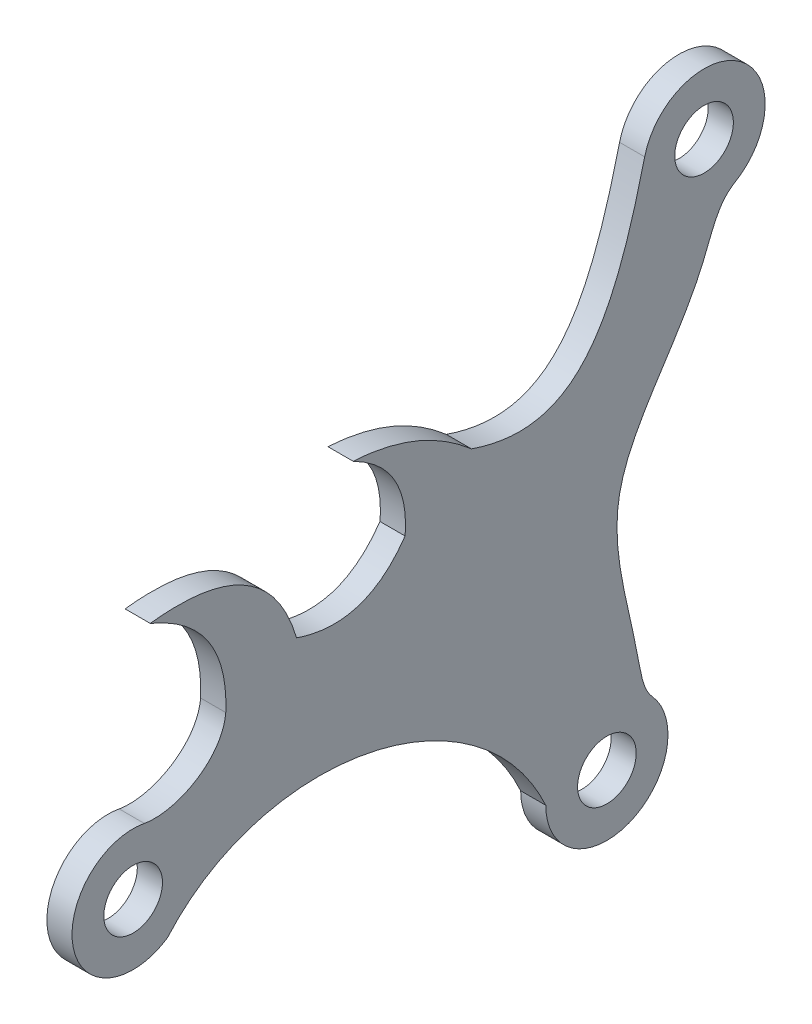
ISO-10303-21;
HEADER;
FILE_DESCRIPTION(('STEP AP214'),'2;1');
FILE_NAME('part.step','',(''),(''),'','','');
FILE_SCHEMA(('AUTOMOTIVE_DESIGN { 1 0 10303 214 1 1 1 1 }'));
ENDSEC;
DATA;
#1=APPLICATION_CONTEXT('core data for automotive mechanical design processes');
#2=APPLICATION_PROTOCOL_DEFINITION('international standard','automotive_design',2000,#1);
#3=PRODUCT_CONTEXT('',#1,'mechanical');
#4=PRODUCT('Part','Part','',(#3));
#5=PRODUCT_RELATED_PRODUCT_CATEGORY('part','',(#4));
#6=PRODUCT_DEFINITION_FORMATION('','',#4);
#7=PRODUCT_DEFINITION_CONTEXT('part definition',#1,'design');
#8=PRODUCT_DEFINITION('design','',#6,#7);
#9=PRODUCT_DEFINITION_SHAPE('','',#8);
#10=(LENGTH_UNIT() NAMED_UNIT(*) SI_UNIT(.MILLI.,.METRE.));
#11=(NAMED_UNIT(*) PLANE_ANGLE_UNIT() SI_UNIT($,.RADIAN.));
#12=(NAMED_UNIT(*) SI_UNIT($,.STERADIAN.) SOLID_ANGLE_UNIT());
#13=UNCERTAINTY_MEASURE_WITH_UNIT(LENGTH_MEASURE(1.E-05),#10,'distance_accuracy_value','');
#14=(GEOMETRIC_REPRESENTATION_CONTEXT(3) GLOBAL_UNCERTAINTY_ASSIGNED_CONTEXT((#13)) GLOBAL_UNIT_ASSIGNED_CONTEXT((#10,
#11,#12)) REPRESENTATION_CONTEXT('',''));
#15=CARTESIAN_POINT('',(0.,0.,0.));
#16=DIRECTION('',(0.,0.,1.));
#17=DIRECTION('',(1.,0.,0.));
#18=AXIS2_PLACEMENT_3D('',#15,#16,#17);
#19=CARTESIAN_POINT('',(6.14583198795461,0.343317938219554,85.1320883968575));
#20=CARTESIAN_POINT('',(6.14583198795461,13.7896292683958,73.4255339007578));
#21=CARTESIAN_POINT('',(6.14583198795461,8.78934319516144,47.9119063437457));
#22=CARTESIAN_POINT('',(6.14583198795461,-8.53825330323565,39.9678569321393));
#23=B_SPLINE_CURVE_WITH_KNOTS('',3,(#19,#20,#21,#22),.UNSPECIFIED.,.F.,.F.,(4,4),(0.,1.),.UNSPECIFIED.);
#24=DIRECTION('',(1.,0.,0.));
#25=VECTOR('',#24,1.);
#26=SURFACE_OF_LINEAR_EXTRUSION('',#23,#25);
#27=DIRECTION('',(1.,0.,0.));
#28=VECTOR('',#27,1.);
#29=CARTESIAN_POINT('',(6.14583198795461,0.343317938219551,85.1320883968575));
#30=LINE('',#29,#28);
#31=CARTESIAN_POINT('',(3.14583198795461,0.343317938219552,85.1320883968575));
#32=VERTEX_POINT('',#31);
#33=CARTESIAN_POINT('',(6.14583198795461,0.343317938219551,85.1320883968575));
#34=VERTEX_POINT('',#33);
#35=EDGE_CURVE('E11',#32,#34,#30,.T.);
#36=ORIENTED_EDGE('',*,*,#35,.F.);
#37=CARTESIAN_POINT('',(3.14583198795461,0.343317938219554,85.1320883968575));
#38=CARTESIAN_POINT('',(3.14583198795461,13.7896292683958,73.4255339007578));
#39=CARTESIAN_POINT('',(3.14583198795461,8.78934319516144,47.9119063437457));
#40=CARTESIAN_POINT('',(3.14583198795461,-8.53825330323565,39.9678569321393));
#41=B_SPLINE_CURVE_WITH_KNOTS('',3,(#37,#38,#39,#40),.UNSPECIFIED.,.F.,.F.,(4,4),(0.,1.),.UNSPECIFIED.);
#42=CARTESIAN_POINT('',(3.14583198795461,-8.53825330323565,39.9678569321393));
#43=VERTEX_POINT('',#42);
#44=EDGE_CURVE('E123',#32,#43,#41,.T.);
#45=ORIENTED_EDGE('',*,*,#44,.T.);
#46=DIRECTION('',(1.,0.,0.));
#47=VECTOR('',#46,1.);
#48=CARTESIAN_POINT('',(6.14583198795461,-8.53825330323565,39.9678569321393));
#49=LINE('',#48,#47);
#50=CARTESIAN_POINT('',(6.14583198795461,-8.53825330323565,39.9678569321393));
#51=VERTEX_POINT('',#50);
#52=EDGE_CURVE('E52',#43,#51,#49,.T.);
#53=ORIENTED_EDGE('',*,*,#52,.T.);
#54=EDGE_CURVE('E240',#34,#51,#23,.T.);
#55=ORIENTED_EDGE('',*,*,#54,.F.);
#56=EDGE_LOOP('',(#36,#45,#53,#55));
#57=FACE_BOUND('',#56,.T.);
#58=ADVANCED_FACE('F42',(#57),#26,.T.);
#59=CARTESIAN_POINT('',(6.14583198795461,-8.53825330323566,32.6761902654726));
#60=DIRECTION('',(1.,0.,0.));
#61=DIRECTION('',(0.,0.,-1.));
#62=AXIS2_PLACEMENT_3D('',#59,#60,#61);
#63=CYLINDRICAL_SURFACE('',#62,7.29166666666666);
#64=ORIENTED_EDGE('',*,*,#52,.F.);
#65=CARTESIAN_POINT('',(3.14583198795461,-8.53825330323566,32.6761902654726));
#66=DIRECTION('',(1.,0.,0.));
#67=DIRECTION('',(0.,0.,-1.));
#68=AXIS2_PLACEMENT_3D('',#65,#66,#67);
#69=CIRCLE('',#68,7.29166666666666);
#70=CARTESIAN_POINT('',(3.14583198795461,-3.65430887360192,27.2618122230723));
#71=VERTEX_POINT('',#70);
#72=EDGE_CURVE('E191',#43,#71,#69,.T.);
#73=ORIENTED_EDGE('',*,*,#72,.T.);
#74=DIRECTION('',(1.,0.,0.));
#75=VECTOR('',#74,1.);
#76=CARTESIAN_POINT('',(6.14583198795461,-3.65430887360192,27.2618122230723));
#77=LINE('',#76,#75);
#78=CARTESIAN_POINT('',(6.14583198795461,-3.65430887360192,27.2618122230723));
#79=VERTEX_POINT('',#78);
#80=EDGE_CURVE('E233',#71,#79,#77,.T.);
#81=ORIENTED_EDGE('',*,*,#80,.T.);
#82=CARTESIAN_POINT('',(6.14583198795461,-8.53825330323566,32.6761902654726));
#83=DIRECTION('',(1.,0.,0.));
#84=DIRECTION('',(0.,0.,-1.));
#85=AXIS2_PLACEMENT_3D('',#82,#83,#84);
#86=CIRCLE('',#85,7.29166666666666);
#87=EDGE_CURVE('E250',#51,#79,#86,.T.);
#88=ORIENTED_EDGE('',*,*,#87,.F.);
#89=EDGE_LOOP('',(#64,#73,#81,#88));
#90=FACE_BOUND('',#89,.T.);
#91=ADVANCED_FACE('F253',(#90),#63,.T.);
#92=CARTESIAN_POINT('',(6.14583198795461,44.5532425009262,17.4187394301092));
#93=CARTESIAN_POINT('',(6.14583198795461,43.4031703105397,19.4015392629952));
#94=CARTESIAN_POINT('',(6.14583198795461,32.9812043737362,22.2499660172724));
#95=CARTESIAN_POINT('',(6.14583198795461,21.0645617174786,34.8204766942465));
#96=CARTESIAN_POINT('',(6.14583198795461,5.59746244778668,29.4926288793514));
#97=CARTESIAN_POINT('',(6.14583198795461,-2.45124837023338,28.3470117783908));
#98=CARTESIAN_POINT('',(6.14583198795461,-3.65430887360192,27.2618122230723));
#99=B_SPLINE_CURVE_WITH_KNOTS('',3,(#92,#93,#94,#95,#96,#97,#98),.UNSPECIFIED.,.F.,.F.,(4,1,1,1,
4),(0.,0.135472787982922,0.556380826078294,0.906488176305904,1.),.UNSPECIFIED.);
#100=DIRECTION('',(1.,0.,0.));
#101=VECTOR('',#100,1.);
#102=SURFACE_OF_LINEAR_EXTRUSION('',#99,#101);
#103=ORIENTED_EDGE('',*,*,#80,.F.);
#104=CARTESIAN_POINT('',(3.14583198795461,44.5532425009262,17.4187394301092));
#105=CARTESIAN_POINT('',(3.14583198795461,43.4031703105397,19.4015392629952));
#106=CARTESIAN_POINT('',(3.14583198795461,32.9812043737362,22.2499660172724));
#107=CARTESIAN_POINT('',(3.14583198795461,21.0645617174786,34.8204766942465));
#108=CARTESIAN_POINT('',(3.14583198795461,5.59746244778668,29.4926288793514));
#109=CARTESIAN_POINT('',(3.14583198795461,-2.45124837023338,28.3470117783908));
#110=CARTESIAN_POINT('',(3.14583198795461,-3.65430887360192,27.2618122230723));
#111=B_SPLINE_CURVE_WITH_KNOTS('',3,(#104,#105,#106,#107,#108,#109,#110),.UNSPECIFIED.,.F.,.F.,
(4,1,1,1,4),(0.,0.135472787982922,0.556380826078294,0.906488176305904,1.),.UNSPECIFIED.);
#112=CARTESIAN_POINT('',(3.14583198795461,44.5532425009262,17.4187394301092));
#113=VERTEX_POINT('',#112);
#114=EDGE_CURVE('E186',#113,#71,#111,.T.);
#115=ORIENTED_EDGE('',*,*,#114,.F.);
#116=DIRECTION('',(1.,0.,0.));
#117=VECTOR('',#116,1.);
#118=CARTESIAN_POINT('',(6.14583198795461,44.5532425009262,17.4187394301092));
#119=LINE('',#118,#117);
#120=CARTESIAN_POINT('',(6.14583198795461,44.5532425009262,17.4187394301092));
#121=VERTEX_POINT('',#120);
#122=EDGE_CURVE('E230',#113,#121,#119,.T.);
#123=ORIENTED_EDGE('',*,*,#122,.T.);
#124=EDGE_CURVE('E254',#121,#79,#99,.T.);
#125=ORIENTED_EDGE('',*,*,#124,.T.);
#126=EDGE_LOOP('',(#103,#115,#123,#125));
#127=FACE_BOUND('',#126,.T.);
#128=ADVANCED_FACE('F271',(#127),#102,.F.);
#129=CARTESIAN_POINT('',(6.14583198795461,50.8606949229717,21.0772154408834));
#130=DIRECTION('',(1.,0.,0.));
#131=DIRECTION('',(0.,0.,-1.));
#132=AXIS2_PLACEMENT_3D('',#129,#130,#131);
#133=CYLINDRICAL_SURFACE('',#132,7.29166666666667);
#134=ORIENTED_EDGE('',*,*,#122,.F.);
#135=CARTESIAN_POINT('',(3.14583198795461,50.8606949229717,21.0772154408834));
#136=DIRECTION('',(1.,0.,0.));
#137=DIRECTION('',(0.,0.,-1.));
#138=AXIS2_PLACEMENT_3D('',#135,#136,#137);
#139=CIRCLE('',#138,7.29166666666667);
#140=CARTESIAN_POINT('',(3.14583198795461,52.5868768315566,28.1616137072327));
#141=VERTEX_POINT('',#140);
#142=EDGE_CURVE('E180',#113,#141,#139,.T.);
#143=ORIENTED_EDGE('',*,*,#142,.T.);
#144=DIRECTION('',(1.,0.,0.));
#145=VECTOR('',#144,1.);
#146=CARTESIAN_POINT('',(6.14583198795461,52.5868768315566,28.1616137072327));
#147=LINE('',#146,#145);
#148=CARTESIAN_POINT('',(6.14583198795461,52.5868768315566,28.1616137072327));
#149=VERTEX_POINT('',#148);
#150=EDGE_CURVE('E227',#141,#149,#147,.T.);
#151=ORIENTED_EDGE('',*,*,#150,.T.);
#152=CARTESIAN_POINT('',(6.14583198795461,50.8606949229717,21.0772154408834));
#153=DIRECTION('',(1.,0.,0.));
#154=DIRECTION('',(0.,0.,-1.));
#155=AXIS2_PLACEMENT_3D('',#152,#153,#154);
#156=CIRCLE('',#155,7.29166666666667);
#157=EDGE_CURVE('E256',#121,#149,#156,.T.);
#158=ORIENTED_EDGE('',*,*,#157,.F.);
#159=EDGE_LOOP('',(#134,#143,#151,#158));
#160=FACE_BOUND('',#159,.T.);
#161=ADVANCED_FACE('F275',(#160),#133,.T.);
#162=CARTESIAN_POINT('',(6.14583198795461,52.5868768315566,28.1616137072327));
#163=CARTESIAN_POINT('',(6.14583198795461,37.0225705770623,31.954006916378));
#164=CARTESIAN_POINT('',(6.14583198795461,28.4922838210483,36.4848949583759));
#165=CARTESIAN_POINT('',(6.14583198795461,32.73852033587,48.8405353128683));
#166=B_SPLINE_CURVE_WITH_KNOTS('',3,(#162,#163,#164,#165),.UNSPECIFIED.,.F.,.F.,(4,4),(0.,1.),.UNSPECIFIED.);
#167=DIRECTION('',(1.,0.,0.));
#168=VECTOR('',#167,1.);
#169=SURFACE_OF_LINEAR_EXTRUSION('',#166,#168);
#170=ORIENTED_EDGE('',*,*,#150,.F.);
#171=CARTESIAN_POINT('',(3.14583198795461,52.5868768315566,28.1616137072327));
#172=CARTESIAN_POINT('',(3.14583198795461,37.0225705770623,31.954006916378));
#173=CARTESIAN_POINT('',(3.14583198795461,28.4922838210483,36.4848949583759));
#174=CARTESIAN_POINT('',(3.14583198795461,32.73852033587,48.8405353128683));
#175=B_SPLINE_CURVE_WITH_KNOTS('',3,(#171,#172,#173,#174),.UNSPECIFIED.,.F.,.F.,(4,4),(0.,1.),.UNSPECIFIED.);
#176=CARTESIAN_POINT('',(3.14583198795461,32.73852033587,48.8405353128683));
#177=VERTEX_POINT('',#176);
#178=EDGE_CURVE('E172',#141,#177,#175,.T.);
#179=ORIENTED_EDGE('',*,*,#178,.T.);
#180=DIRECTION('',(1.,0.,0.));
#181=VECTOR('',#180,1.);
#182=CARTESIAN_POINT('',(6.14583198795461,32.73852033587,48.8405353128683));
#183=LINE('',#182,#181);
#184=CARTESIAN_POINT('',(6.14583198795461,32.73852033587,48.8405353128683));
#185=VERTEX_POINT('',#184);
#186=EDGE_CURVE('E224',#177,#185,#183,.T.);
#187=ORIENTED_EDGE('',*,*,#186,.T.);
#188=EDGE_CURVE('E390',#149,#185,#166,.T.);
#189=ORIENTED_EDGE('',*,*,#188,.F.);
#190=EDGE_LOOP('',(#170,#179,#187,#189));
#191=FACE_BOUND('',#190,.T.);
#192=ADVANCED_FACE('F401',(#191),#169,.T.);
#193=CARTESIAN_POINT('',(6.14583198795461,32.73852033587,48.8405353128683));
#194=CARTESIAN_POINT('',(6.14583198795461,38.0909383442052,54.9856397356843));
#195=CARTESIAN_POINT('',(6.14583198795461,38.5121487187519,62.9527206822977));
#196=B_SPLINE_CURVE_WITH_KNOTS('',2,(#193,#194,#195),.UNSPECIFIED.,.F.,.F.,(3,3),(0.,1.),.UNSPECIFIED.);
#197=DIRECTION('',(1.,0.,0.));
#198=VECTOR('',#197,1.);
#199=SURFACE_OF_LINEAR_EXTRUSION('',#196,#198);
#200=ORIENTED_EDGE('',*,*,#186,.F.);
#201=CARTESIAN_POINT('',(3.14583198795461,32.73852033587,48.8405353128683));
#202=CARTESIAN_POINT('',(3.14583198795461,38.0909383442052,54.9856397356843));
#203=CARTESIAN_POINT('',(3.14583198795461,38.5121487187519,62.9527206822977));
#204=B_SPLINE_CURVE_WITH_KNOTS('',2,(#201,#202,#203),.UNSPECIFIED.,.F.,.F.,(3,3),(0.,1.),.UNSPECIFIED.);
#205=CARTESIAN_POINT('',(3.14583198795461,38.5121487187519,62.9527206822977));
#206=VERTEX_POINT('',#205);
#207=EDGE_CURVE('E164',#177,#206,#204,.T.);
#208=ORIENTED_EDGE('',*,*,#207,.T.);
#209=DIRECTION('',(1.,0.,0.));
#210=VECTOR('',#209,1.);
#211=CARTESIAN_POINT('',(6.14583198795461,38.5121487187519,62.9527206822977));
#212=LINE('',#211,#210);
#213=CARTESIAN_POINT('',(6.14583198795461,38.5121487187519,62.9527206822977));
#214=VERTEX_POINT('',#213);
#215=EDGE_CURVE('E221',#206,#214,#212,.T.);
#216=ORIENTED_EDGE('',*,*,#215,.T.);
#217=EDGE_CURVE('E383',#185,#214,#196,.T.);
#218=ORIENTED_EDGE('',*,*,#217,.F.);
#219=EDGE_LOOP('',(#200,#208,#216,#218));
#220=FACE_BOUND('',#219,.T.);
#221=ADVANCED_FACE('F377',(#220),#199,.T.);
#222=CARTESIAN_POINT('',(6.14583198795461,38.5121487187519,62.9527206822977));
#223=CARTESIAN_POINT('',(6.14583198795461,35.0827299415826,56.1660947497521));
#224=CARTESIAN_POINT('',(6.14583198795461,27.6950162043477,56.7617602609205));
#225=B_SPLINE_CURVE_WITH_KNOTS('',2,(#222,#223,#224),.UNSPECIFIED.,.F.,.F.,(3,3),(0.,1.),.UNSPECIFIED.);
#226=DIRECTION('',(1.,0.,0.));
#227=VECTOR('',#226,1.);
#228=SURFACE_OF_LINEAR_EXTRUSION('',#225,#227);
#229=ORIENTED_EDGE('',*,*,#215,.F.);
#230=CARTESIAN_POINT('',(3.14583198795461,38.5121487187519,62.9527206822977));
#231=CARTESIAN_POINT('',(3.14583198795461,35.0827299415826,56.1660947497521));
#232=CARTESIAN_POINT('',(3.14583198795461,27.6950162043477,56.7617602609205));
#233=B_SPLINE_CURVE_WITH_KNOTS('',2,(#230,#231,#232),.UNSPECIFIED.,.F.,.F.,(3,3),(0.,1.),.UNSPECIFIED.);
#234=CARTESIAN_POINT('',(3.14583198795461,27.6950162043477,56.7617602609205));
#235=VERTEX_POINT('',#234);
#236=EDGE_CURVE('E156',#206,#235,#233,.T.);
#237=ORIENTED_EDGE('',*,*,#236,.T.);
#238=DIRECTION('',(1.,0.,0.));
#239=VECTOR('',#238,1.);
#240=CARTESIAN_POINT('',(6.14583198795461,27.6950162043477,56.7617602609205));
#241=LINE('',#240,#239);
#242=CARTESIAN_POINT('',(6.14583198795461,27.6950162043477,56.7617602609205));
#243=VERTEX_POINT('',#242);
#244=EDGE_CURVE('E218',#235,#243,#241,.T.);
#245=ORIENTED_EDGE('',*,*,#244,.T.);
#246=EDGE_CURVE('E351',#214,#243,#225,.T.);
#247=ORIENTED_EDGE('',*,*,#246,.F.);
#248=EDGE_LOOP('',(#229,#237,#245,#247));
#249=FACE_BOUND('',#248,.T.);
#250=ADVANCED_FACE('F374',(#249),#228,.T.);
#251=CARTESIAN_POINT('',(6.14583198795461,27.6950162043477,56.7617602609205));
#252=CARTESIAN_POINT('',(6.14583198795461,20.8335416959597,61.4807086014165));
#253=CARTESIAN_POINT('',(6.14583198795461,23.6385915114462,69.7134285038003));
#254=B_SPLINE_CURVE_WITH_KNOTS('',2,(#251,#252,#253),.UNSPECIFIED.,.F.,.F.,(3,3),(0.,1.),.UNSPECIFIED.);
#255=DIRECTION('',(1.,0.,0.));
#256=VECTOR('',#255,1.);
#257=SURFACE_OF_LINEAR_EXTRUSION('',#254,#256);
#258=ORIENTED_EDGE('',*,*,#244,.F.);
#259=CARTESIAN_POINT('',(3.14583198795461,27.6950162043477,56.7617602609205));
#260=CARTESIAN_POINT('',(3.14583198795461,20.8335416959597,61.4807086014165));
#261=CARTESIAN_POINT('',(3.14583198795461,23.6385915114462,69.7134285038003));
#262=B_SPLINE_CURVE_WITH_KNOTS('',2,(#259,#260,#261),.UNSPECIFIED.,.F.,.F.,(3,3),(0.,1.),.UNSPECIFIED.);
#263=CARTESIAN_POINT('',(3.14583198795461,23.6385915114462,69.7134285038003));
#264=VERTEX_POINT('',#263);
#265=EDGE_CURVE('E148',#235,#264,#262,.T.);
#266=ORIENTED_EDGE('',*,*,#265,.T.);
#267=DIRECTION('',(1.,0.,0.));
#268=VECTOR('',#267,1.);
#269=CARTESIAN_POINT('',(6.14583198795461,23.6385915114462,69.7134285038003));
#270=LINE('',#269,#268);
#271=CARTESIAN_POINT('',(6.14583198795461,23.6385915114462,69.7134285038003));
#272=VERTEX_POINT('',#271);
#273=EDGE_CURVE('E215',#264,#272,#270,.T.);
#274=ORIENTED_EDGE('',*,*,#273,.T.);
#275=EDGE_CURVE('E342',#243,#272,#254,.T.);
#276=ORIENTED_EDGE('',*,*,#275,.F.);
#277=EDGE_LOOP('',(#258,#266,#274,#276));
#278=FACE_BOUND('',#277,.T.);
#279=ADVANCED_FACE('F341',(#278),#257,.T.);
#280=CARTESIAN_POINT('',(6.14583198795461,23.6385915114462,69.7134285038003));
#281=CARTESIAN_POINT('',(6.14583198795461,35.5253253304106,73.2135992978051));
#282=CARTESIAN_POINT('',(6.14583198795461,33.8690175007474,87.1785903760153));
#283=B_SPLINE_CURVE_WITH_KNOTS('',2,(#280,#281,#282),.UNSPECIFIED.,.F.,.F.,(3,3),(0.,1.),.UNSPECIFIED.);
#284=DIRECTION('',(1.,0.,0.));
#285=VECTOR('',#284,1.);
#286=SURFACE_OF_LINEAR_EXTRUSION('',#283,#285);
#287=ORIENTED_EDGE('',*,*,#273,.F.);
#288=CARTESIAN_POINT('',(3.14583198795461,23.6385915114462,69.7134285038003));
#289=CARTESIAN_POINT('',(3.14583198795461,35.5253253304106,73.2135992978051));
#290=CARTESIAN_POINT('',(3.14583198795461,33.8690175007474,87.1785903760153));
#291=B_SPLINE_CURVE_WITH_KNOTS('',2,(#288,#289,#290),.UNSPECIFIED.,.F.,.F.,(3,3),(0.,1.),.UNSPECIFIED.);
#292=CARTESIAN_POINT('',(3.14583198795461,33.8690175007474,87.1785903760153));
#293=VERTEX_POINT('',#292);
#294=EDGE_CURVE('E140',#264,#293,#291,.T.);
#295=ORIENTED_EDGE('',*,*,#294,.T.);
#296=DIRECTION('',(1.,0.,0.));
#297=VECTOR('',#296,1.);
#298=CARTESIAN_POINT('',(6.14583198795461,33.8690175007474,87.1785903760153));
#299=LINE('',#298,#297);
#300=CARTESIAN_POINT('',(6.14583198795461,33.8690175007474,87.1785903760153));
#301=VERTEX_POINT('',#300);
#302=EDGE_CURVE('E213',#293,#301,#299,.T.);
#303=ORIENTED_EDGE('',*,*,#302,.T.);
#304=EDGE_CURVE('E348',#272,#301,#283,.T.);
#305=ORIENTED_EDGE('',*,*,#304,.F.);
#306=EDGE_LOOP('',(#287,#295,#303,#305));
#307=FACE_BOUND('',#306,.T.);
#308=ADVANCED_FACE('F353',(#307),#286,.T.);
#309=CARTESIAN_POINT('',(6.14583198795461,33.8690175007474,87.1785903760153));
#310=CARTESIAN_POINT('',(6.14583198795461,29.9624277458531,77.7632755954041));
#311=CARTESIAN_POINT('',(6.14583198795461,20.1455591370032,78.1643132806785));
#312=B_SPLINE_CURVE_WITH_KNOTS('',2,(#309,#310,#311),.UNSPECIFIED.,.F.,.F.,(3,3),(0.,1.),.UNSPECIFIED.);
#313=DIRECTION('',(1.,0.,0.));
#314=VECTOR('',#313,1.);
#315=SURFACE_OF_LINEAR_EXTRUSION('',#312,#314);
#316=ORIENTED_EDGE('',*,*,#302,.F.);
#317=CARTESIAN_POINT('',(3.14583198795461,33.8690175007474,87.1785903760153));
#318=CARTESIAN_POINT('',(3.14583198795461,29.9624277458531,77.7632755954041));
#319=CARTESIAN_POINT('',(3.14583198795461,20.1455591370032,78.1643132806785));
#320=B_SPLINE_CURVE_WITH_KNOTS('',2,(#317,#318,#319),.UNSPECIFIED.,.F.,.F.,(3,3),(0.,1.),.UNSPECIFIED.);
#321=CARTESIAN_POINT('',(3.14583198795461,20.1455591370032,78.1643132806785));
#322=VERTEX_POINT('',#321);
#323=EDGE_CURVE('E132',#293,#322,#320,.T.);
#324=ORIENTED_EDGE('',*,*,#323,.T.);
#325=DIRECTION('',(1.,0.,0.));
#326=VECTOR('',#325,1.);
#327=CARTESIAN_POINT('',(6.14583198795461,20.1455591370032,78.1643132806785));
#328=LINE('',#327,#326);
#329=CARTESIAN_POINT('',(6.14583198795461,20.1455591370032,78.1643132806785));
#330=VERTEX_POINT('',#329);
#331=EDGE_CURVE('E60',#322,#330,#328,.T.);
#332=ORIENTED_EDGE('',*,*,#331,.T.);
#333=EDGE_CURVE('E324',#301,#330,#312,.T.);
#334=ORIENTED_EDGE('',*,*,#333,.F.);
#335=EDGE_LOOP('',(#316,#324,#332,#334));
#336=FACE_BOUND('',#335,.T.);
#337=ADVANCED_FACE('F313',(#336),#315,.T.);
#338=CARTESIAN_POINT('',(6.14583198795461,20.1455591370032,78.1643132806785));
#339=CARTESIAN_POINT('',(6.14583198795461,15.7182550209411,78.5509244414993));
#340=CARTESIAN_POINT('',(6.14583198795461,12.8280881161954,84.0053660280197));
#341=CARTESIAN_POINT('',(6.14583198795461,13.5499482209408,87.8870350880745));
#342=B_SPLINE_CURVE_WITH_KNOTS('',3,(#338,#339,#340,#341),.UNSPECIFIED.,.F.,.F.,(4,4),(0.,1.),.UNSPECIFIED.);
#343=DIRECTION('',(1.,0.,0.));
#344=VECTOR('',#343,1.);
#345=SURFACE_OF_LINEAR_EXTRUSION('',#342,#344);
#346=ORIENTED_EDGE('',*,*,#331,.F.);
#347=CARTESIAN_POINT('',(3.14583198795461,20.1455591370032,78.1643132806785));
#348=CARTESIAN_POINT('',(3.14583198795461,15.7182550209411,78.5509244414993));
#349=CARTESIAN_POINT('',(3.14583198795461,12.8280881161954,84.0053660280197));
#350=CARTESIAN_POINT('',(3.14583198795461,13.5499482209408,87.8870350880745));
#351=B_SPLINE_CURVE_WITH_KNOTS('',3,(#347,#348,#349,#350),.UNSPECIFIED.,.F.,.F.,(4,4),(0.,1.),.UNSPECIFIED.);
#352=CARTESIAN_POINT('',(3.14583198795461,13.5499482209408,87.8870350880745));
#353=VERTEX_POINT('',#352);
#354=EDGE_CURVE('E121',#322,#353,#351,.T.);
#355=ORIENTED_EDGE('',*,*,#354,.T.);
#356=DIRECTION('',(1.,0.,0.));
#357=VECTOR('',#356,1.);
#358=CARTESIAN_POINT('',(6.14583198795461,13.5499482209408,87.8870350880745));
#359=LINE('',#358,#357);
#360=CARTESIAN_POINT('',(6.14583198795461,13.5499482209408,87.8870350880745));
#361=VERTEX_POINT('',#360);
#362=EDGE_CURVE('E46',#353,#361,#359,.T.);
#363=ORIENTED_EDGE('',*,*,#362,.T.);
#364=EDGE_CURVE('E211',#330,#361,#342,.T.);
#365=ORIENTED_EDGE('',*,*,#364,.F.);
#366=EDGE_LOOP('',(#346,#355,#363,#365));
#367=FACE_BOUND('',#366,.T.);
#368=ADVANCED_FACE('F125',(#367),#345,.T.);
#369=CARTESIAN_POINT('',(6.14583198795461,6.38118838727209,89.2201837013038));
#370=DIRECTION('',(1.,0.,0.));
#371=DIRECTION('',(0.,0.,-1.));
#372=AXIS2_PLACEMENT_3D('',#369,#370,#371);
#373=CYLINDRICAL_SURFACE('',#372,7.29166666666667);
#374=CARTESIAN_POINT('',(3.14583198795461,6.38118838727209,89.2201837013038));
#375=DIRECTION('',(1.,0.,0.));
#376=DIRECTION('',(0.,0.,-1.));
#377=AXIS2_PLACEMENT_3D('',#374,#375,#376);
#378=CIRCLE('',#377,7.29166666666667);
#379=EDGE_CURVE('E109',#353,#32,#378,.T.);
#380=ORIENTED_EDGE('',*,*,#379,.T.);
#381=ORIENTED_EDGE('',*,*,#35,.T.);
#382=CARTESIAN_POINT('',(6.14583198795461,6.38118838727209,89.2201837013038));
#383=DIRECTION('',(1.,0.,0.));
#384=DIRECTION('',(0.,0.,-1.));
#385=AXIS2_PLACEMENT_3D('',#382,#383,#384);
#386=CIRCLE('',#385,7.29166666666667);
#387=EDGE_CURVE('E111',#361,#34,#386,.T.);
#388=ORIENTED_EDGE('',*,*,#387,.F.);
#389=ORIENTED_EDGE('',*,*,#362,.F.);
#390=EDGE_LOOP('',(#380,#381,#388,#389));
#391=FACE_BOUND('',#390,.T.);
#392=ADVANCED_FACE('F108',(#391),#373,.T.);
#393=CARTESIAN_POINT('',(6.14583198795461,6.38118838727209,89.2201837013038));
#394=DIRECTION('',(1.,0.,0.));
#395=DIRECTION('',(0.,0.,-1.));
#396=AXIS2_PLACEMENT_3D('',#393,#394,#395);
#397=CYLINDRICAL_SURFACE('',#396,3.5);
#398=CARTESIAN_POINT('',(6.14583198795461,6.38118838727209,89.2201837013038));
#399=DIRECTION('',(1.,0.,0.));
#400=DIRECTION('',(0.,0.,-1.));
#401=AXIS2_PLACEMENT_3D('',#398,#399,#400);
#402=CIRCLE('',#401,3.5);
#403=CARTESIAN_POINT('',(6.14583198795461,6.38118838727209,85.7201837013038));
#404=VERTEX_POINT('',#403);
#405=EDGE_CURVE('E355',#404,#404,#402,.T.);
#406=ORIENTED_EDGE('',*,*,#405,.T.);
#407=EDGE_LOOP('',(#406));
#408=FACE_BOUND('',#407,.T.);
#409=CARTESIAN_POINT('',(3.14583198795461,6.38118838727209,89.2201837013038));
#410=DIRECTION('',(1.,0.,0.));
#411=DIRECTION('',(0.,0.,-1.));
#412=AXIS2_PLACEMENT_3D('',#409,#410,#411);
#413=CIRCLE('',#412,3.5);
#414=CARTESIAN_POINT('',(3.14583198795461,6.38118838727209,85.7201837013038));
#415=VERTEX_POINT('',#414);
#416=EDGE_CURVE('E139',#415,#415,#413,.T.);
#417=ORIENTED_EDGE('',*,*,#416,.F.);
#418=EDGE_LOOP('',(#417));
#419=FACE_BOUND('',#418,.T.);
#420=ADVANCED_FACE('F284',(#408,#419),#397,.F.);
#421=CARTESIAN_POINT('',(6.14583198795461,-8.53825330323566,32.6761902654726));
#422=DIRECTION('',(1.,0.,0.));
#423=DIRECTION('',(0.,0.,-1.));
#424=AXIS2_PLACEMENT_3D('',#421,#422,#423);
#425=CYLINDRICAL_SURFACE('',#424,3.5);
#426=CARTESIAN_POINT('',(6.14583198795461,-8.53825330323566,32.6761902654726));
#427=DIRECTION('',(1.,0.,0.));
#428=DIRECTION('',(0.,0.,-1.));
#429=AXIS2_PLACEMENT_3D('',#426,#427,#428);
#430=CIRCLE('',#429,3.5);
#431=CARTESIAN_POINT('',(6.14583198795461,-8.53825330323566,29.1761902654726));
#432=VERTEX_POINT('',#431);
#433=EDGE_CURVE('E297',#432,#432,#430,.T.);
#434=ORIENTED_EDGE('',*,*,#433,.T.);
#435=EDGE_LOOP('',(#434));
#436=FACE_BOUND('',#435,.T.);
#437=CARTESIAN_POINT('',(3.14583198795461,-8.53825330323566,32.6761902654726));
#438=DIRECTION('',(1.,0.,0.));
#439=DIRECTION('',(0.,0.,-1.));
#440=AXIS2_PLACEMENT_3D('',#437,#438,#439);
#441=CIRCLE('',#440,3.5);
#442=CARTESIAN_POINT('',(3.14583198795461,-8.53825330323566,29.1761902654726));
#443=VERTEX_POINT('',#442);
#444=EDGE_CURVE('E205',#443,#443,#441,.T.);
#445=ORIENTED_EDGE('',*,*,#444,.F.);
#446=EDGE_LOOP('',(#445));
#447=FACE_BOUND('',#446,.T.);
#448=ADVANCED_FACE('F286',(#436,#447),#425,.F.);
#449=CARTESIAN_POINT('',(6.14583198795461,50.8606949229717,21.0772154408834));
#450=DIRECTION('',(1.,0.,0.));
#451=DIRECTION('',(0.,0.,-1.));
#452=AXIS2_PLACEMENT_3D('',#449,#450,#451);
#453=CYLINDRICAL_SURFACE('',#452,3.5);
#454=CARTESIAN_POINT('',(6.14583198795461,50.8606949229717,21.0772154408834));
#455=DIRECTION('',(1.,0.,0.));
#456=DIRECTION('',(0.,0.,-1.));
#457=AXIS2_PLACEMENT_3D('',#454,#455,#456);
#458=CIRCLE('',#457,3.5);
#459=CARTESIAN_POINT('',(6.14583198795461,50.8606949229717,17.5772154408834));
#460=VERTEX_POINT('',#459);
#461=EDGE_CURVE('E115',#460,#460,#458,.T.);
#462=ORIENTED_EDGE('',*,*,#461,.T.);
#463=EDGE_LOOP('',(#462));
#464=FACE_BOUND('',#463,.T.);
#465=CARTESIAN_POINT('',(3.14583198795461,50.8606949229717,21.0772154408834));
#466=DIRECTION('',(1.,0.,0.));
#467=DIRECTION('',(0.,0.,-1.));
#468=AXIS2_PLACEMENT_3D('',#465,#466,#467);
#469=CIRCLE('',#468,3.5);
#470=CARTESIAN_POINT('',(3.14583198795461,50.8606949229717,17.5772154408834));
#471=VERTEX_POINT('',#470);
#472=EDGE_CURVE('E208',#471,#471,#469,.T.);
#473=ORIENTED_EDGE('',*,*,#472,.F.);
#474=EDGE_LOOP('',(#473));
#475=FACE_BOUND('',#474,.T.);
#476=ADVANCED_FACE('F44',(#464,#475),#453,.F.);
#477=CARTESIAN_POINT('',(6.14583198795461,-8.53825330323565,-22.740476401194));
#478=DIRECTION('',(1.,0.,0.));
#479=DIRECTION('',(0.,0.,-1.));
#480=AXIS2_PLACEMENT_3D('',#477,#478,#479);
#481=PLANE('',#480);
#482=ORIENTED_EDGE('',*,*,#364,.T.);
#483=ORIENTED_EDGE('',*,*,#387,.T.);
#484=ORIENTED_EDGE('',*,*,#54,.T.);
#485=ORIENTED_EDGE('',*,*,#87,.T.);
#486=ORIENTED_EDGE('',*,*,#124,.F.);
#487=ORIENTED_EDGE('',*,*,#157,.T.);
#488=ORIENTED_EDGE('',*,*,#188,.T.);
#489=ORIENTED_EDGE('',*,*,#217,.T.);
#490=ORIENTED_EDGE('',*,*,#246,.T.);
#491=ORIENTED_EDGE('',*,*,#275,.T.);
#492=ORIENTED_EDGE('',*,*,#304,.T.);
#493=ORIENTED_EDGE('',*,*,#333,.T.);
#494=EDGE_LOOP('',(#482,#483,#484,#485,#486,#487,#488,#489,#490,#491,#492,#493));
#495=FACE_BOUND('',#494,.T.);
#496=ORIENTED_EDGE('',*,*,#405,.F.);
#497=EDGE_LOOP('',(#496));
#498=FACE_BOUND('',#497,.T.);
#499=ORIENTED_EDGE('',*,*,#433,.F.);
#500=EDGE_LOOP('',(#499));
#501=FACE_BOUND('',#500,.T.);
#502=ORIENTED_EDGE('',*,*,#461,.F.);
#503=EDGE_LOOP('',(#502));
#504=FACE_BOUND('',#503,.T.);
#505=ADVANCED_FACE('F247',(#495,#498,#501,#504),#481,.T.);
#506=CARTESIAN_POINT('',(3.14583198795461,-8.53825330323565,-22.740476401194));
#507=DIRECTION('',(1.,0.,0.));
#508=DIRECTION('',(0.,0.,-1.));
#509=AXIS2_PLACEMENT_3D('',#506,#507,#508);
#510=PLANE('',#509);
#511=ORIENTED_EDGE('',*,*,#354,.F.);
#512=ORIENTED_EDGE('',*,*,#323,.F.);
#513=ORIENTED_EDGE('',*,*,#294,.F.);
#514=ORIENTED_EDGE('',*,*,#265,.F.);
#515=ORIENTED_EDGE('',*,*,#236,.F.);
#516=ORIENTED_EDGE('',*,*,#207,.F.);
#517=ORIENTED_EDGE('',*,*,#178,.F.);
#518=ORIENTED_EDGE('',*,*,#142,.F.);
#519=ORIENTED_EDGE('',*,*,#114,.T.);
#520=ORIENTED_EDGE('',*,*,#72,.F.);
#521=ORIENTED_EDGE('',*,*,#44,.F.);
#522=ORIENTED_EDGE('',*,*,#379,.F.);
#523=EDGE_LOOP('',(#511,#512,#513,#514,#515,#516,#517,#518,#519,#520,#521,#522));
#524=FACE_BOUND('',#523,.T.);
#525=ORIENTED_EDGE('',*,*,#416,.T.);
#526=EDGE_LOOP('',(#525));
#527=FACE_BOUND('',#526,.T.);
#528=ORIENTED_EDGE('',*,*,#444,.T.);
#529=EDGE_LOOP('',(#528));
#530=FACE_BOUND('',#529,.T.);
#531=ORIENTED_EDGE('',*,*,#472,.T.);
#532=EDGE_LOOP('',(#531));
#533=FACE_BOUND('',#532,.T.);
#534=ADVANCED_FACE('F118',(#524,#527,#530,#533),#510,.F.);
#535=CLOSED_SHELL('',(#58,#91,#128,#161,#192,#221,#250,#279,#308,#337,#368,#392,#420,#448,#476,
#505,#534));
#536=MANIFOLD_SOLID_BREP('B2',#535);
#537=ADVANCED_BREP_SHAPE_REPRESENTATION('',(#18,#536),#14);
#538=SHAPE_DEFINITION_REPRESENTATION(#9,#537);
ENDSEC;
END-ISO-10303-21;
